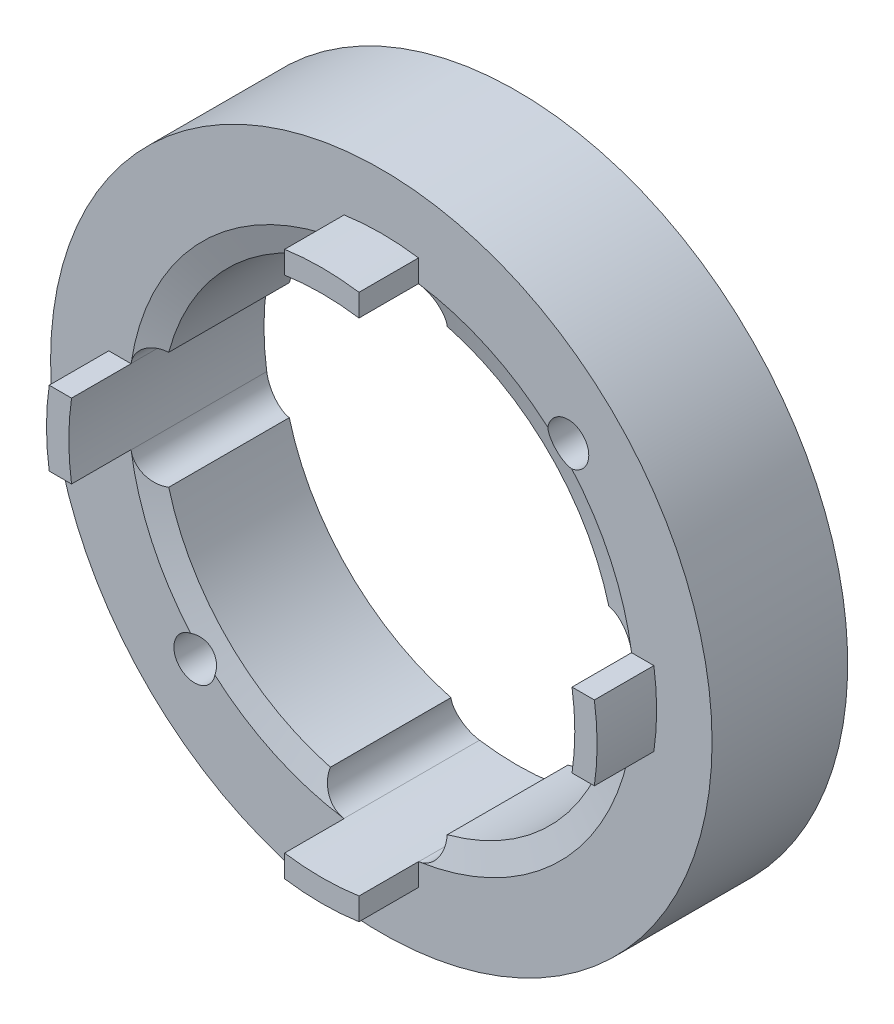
from build123d import *

# Parameters (mm, degrees)
SKETCH1_R                       = 22.225
BOSS_EXTRUDE1_DEPTH             = 9.5
CUT_EXTRUDE1_REACH              = 34.835
SKETCH2_R                       = 15.3
BOSS_EXTRUDE2_START             = -9.113475
BOSS_EXTRUDE2_DEPTH             = 13.113475
CUT_EXTRUDE3_DEPTH              = 33.725474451
CIRPATTERN1_COUNT               = 4
F_7_64_0_10938_DIAMETER_HOLE1_D = 2.778252


with BuildPart() as part:
    # Sketch1 → Boss-Extrude1 (new body)
    with BuildSketch(Plane.XY):
        Circle(SKETCH1_R)
    extrude(amount=BOSS_EXTRUDE1_DEPTH)

    # Sketch2 → Cut-Extrude1 (cut, up to next)
    with BuildSketch(Plane.XY.offset(9.5), mode=Mode.PRIVATE) as cut_extrude1_sk1:
        Circle(SKETCH2_R)
    cut_extrude1_tool1 = extrude(cut_extrude1_sk1.sketch, amount=-CUT_EXTRUDE1_REACH, mode=Mode.PRIVATE) & part.part
    add(cut_extrude1_tool1.solids().sort_by_distance((0, 0, 9.5))[0], mode=Mode.SUBTRACT)

    # Sketch3 → Cut-Revolve1 (revolve, cut)
    with BuildSketch(Plane(origin=(0, 0, 0), x_dir=(1, 0, 0), z_dir=(0, 1, 0))):
        Polygon((-15, -0.98693418), (-17, -0.38652492), (-22.225, -0.38652492), (-22.225, 0), (-15, 0), align=None)
        Polygon((-15, -8.9074591), (-17, -9.5), (-15, -9.5), align=None)
    revolve(axis=Axis((0, 0, 0), (0, 0, 1)), mode=Mode.SUBTRACT)

    # Sketch5 → Boss-Extrude2 (add)
    with BuildSketch(Plane.XY.offset(9.5).offset(BOSS_EXTRUDE2_START)):
        with BuildLine():
            Line((-18.315171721, 2.5), (-16.815171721, 2.5))
            ThreePointArc((-16.815171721, 2.5), (-17, 0), (-16.815171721, -2.5))
            Line((-16.815171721, -2.5), (-18.315171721, -2.5))
            ThreePointArc((-18.315171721, -2.5), (-18.5, 0), (-18.315171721, 2.5))
        make_face()
    boss_extrude2 = extrude(amount=BOSS_EXTRUDE2_DEPTH)

    # Sketch6 → Cut-Extrude3 (cut, through all)
    with BuildSketch(Plane.XY.offset(9.5)):
        with BuildLine():
            ThreePointArc((-16.813269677, 2.512759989), (-17, 0), (-16.813269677, -2.512759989))
            ThreePointArc((-16.813269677, -2.512759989), (-14.880666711, -3.942810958), (-13.450615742, -2.010207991))
            ThreePointArc((-13.450615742, -2.010207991), (-13.6, 0), (-13.450615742, 2.010207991))
            ThreePointArc((-13.450615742, 2.010207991), (-14.880666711, 3.942810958), (-16.813269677, 2.512759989))
        make_face()
    cut_extrude3 = extrude(amount=-CUT_EXTRUDE3_DEPTH, mode=Mode.SUBTRACT)

    # CirPattern1: Boss-Extrude2, Cut-Extrude3 ×4 about axis
    cirpattern1_axis = Axis((0, 0, 0), (0, 0, 1))
    add([boss_extrude2.rotate(cirpattern1_axis, i * 360 / CIRPATTERN1_COUNT) for i in range(1, CIRPATTERN1_COUNT)])
    add([cut_extrude3.rotate(cirpattern1_axis, i * 360 / CIRPATTERN1_COUNT) for i in range(1, CIRPATTERN1_COUNT)], mode=Mode.SUBTRACT)

    # 7_64 _0.10938_ Diameter Hole1 (through all)
    with Locations(Plane.XY.offset(9.5)):
        with Locations((-12.551145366, -12.551145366), (12.551145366, 12.551145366)):
            Hole(F_7_64_0_10938_DIAMETER_HOLE1_D / 2)


solid = part.part
